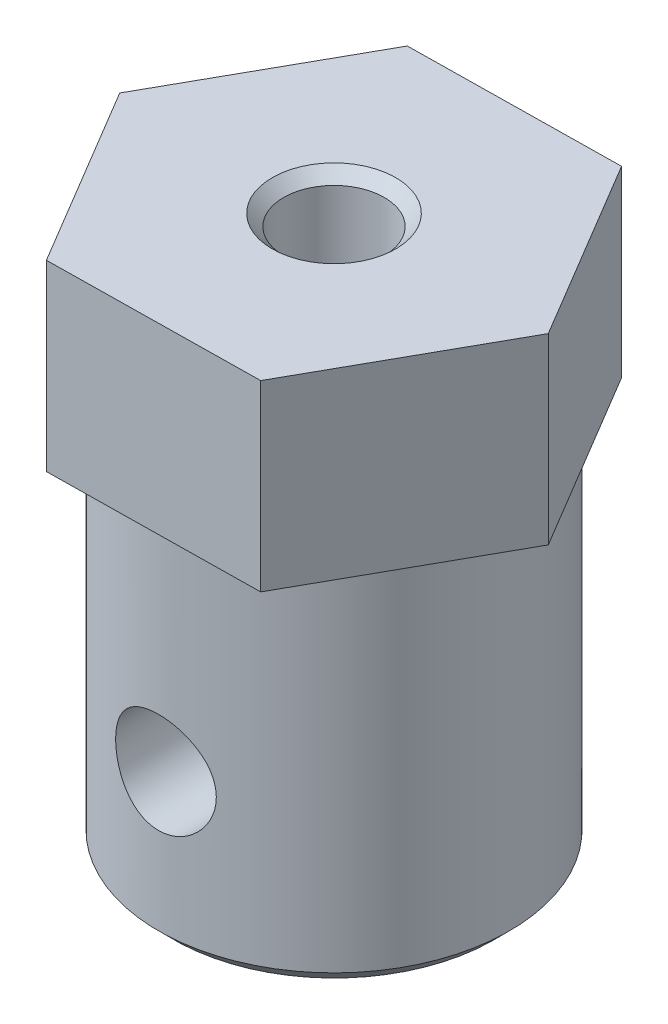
ISO-10303-21;
HEADER;
FILE_DESCRIPTION(('STEP AP214'),'2;1');
FILE_NAME('part.step','',(''),(''),'','','');
FILE_SCHEMA(('AUTOMOTIVE_DESIGN { 1 0 10303 214 1 1 1 1 }'));
ENDSEC;
DATA;
#1=APPLICATION_CONTEXT('core data for automotive mechanical design processes');
#2=APPLICATION_PROTOCOL_DEFINITION('international standard','automotive_design',2000,#1);
#3=PRODUCT_CONTEXT('',#1,'mechanical');
#4=PRODUCT('Part','Part','',(#3));
#5=PRODUCT_RELATED_PRODUCT_CATEGORY('part','',(#4));
#6=PRODUCT_DEFINITION_FORMATION('','',#4);
#7=PRODUCT_DEFINITION_CONTEXT('part definition',#1,'design');
#8=PRODUCT_DEFINITION('design','',#6,#7);
#9=PRODUCT_DEFINITION_SHAPE('','',#8);
#10=(LENGTH_UNIT() NAMED_UNIT(*) SI_UNIT(.MILLI.,.METRE.));
#11=(NAMED_UNIT(*) PLANE_ANGLE_UNIT() SI_UNIT($,.RADIAN.));
#12=(NAMED_UNIT(*) SI_UNIT($,.STERADIAN.) SOLID_ANGLE_UNIT());
#13=UNCERTAINTY_MEASURE_WITH_UNIT(LENGTH_MEASURE(1.E-05),#10,'distance_accuracy_value','');
#14=(GEOMETRIC_REPRESENTATION_CONTEXT(3) GLOBAL_UNCERTAINTY_ASSIGNED_CONTEXT((#13)) GLOBAL_UNIT_ASSIGNED_CONTEXT((#10,
#11,#12)) REPRESENTATION_CONTEXT('',''));
#15=CARTESIAN_POINT('',(0.,0.,0.));
#16=DIRECTION('',(0.,0.,1.));
#17=DIRECTION('',(1.,0.,0.));
#18=AXIS2_PLACEMENT_3D('',#15,#16,#17);
#19=CARTESIAN_POINT('',(0.,0.,0.));
#20=DIRECTION('',(0.,1.,0.));
#21=DIRECTION('',(0.,0.,1.));
#22=AXIS2_PLACEMENT_3D('',#19,#20,#21);
#23=PLANE('',#22);
#24=CARTESIAN_POINT('',(0.,0.,0.));
#25=DIRECTION('',(0.,1.,0.));
#26=DIRECTION('',(0.,0.,1.));
#27=AXIS2_PLACEMENT_3D('',#24,#25,#26);
#28=CIRCLE('',#27,1.65);
#29=CARTESIAN_POINT('',(0.,0.,1.65));
#30=VERTEX_POINT('',#29);
#31=EDGE_CURVE('E136',#30,#30,#28,.T.);
#32=ORIENTED_EDGE('',*,*,#31,.T.);
#33=EDGE_LOOP('',(#32));
#34=FACE_BOUND('',#33,.T.);
#35=CARTESIAN_POINT('',(0.,0.,0.));
#36=DIRECTION('',(0.,-1.,0.));
#37=DIRECTION('',(0.,0.,-1.));
#38=AXIS2_PLACEMENT_3D('',#35,#36,#37);
#39=CIRCLE('',#38,3.);
#40=CARTESIAN_POINT('',(0.,0.,-3.));
#41=VERTEX_POINT('',#40);
#42=EDGE_CURVE('E183',#41,#41,#39,.T.);
#43=ORIENTED_EDGE('',*,*,#42,.T.);
#44=EDGE_LOOP('',(#43));
#45=FACE_BOUND('',#44,.T.);
#46=ADVANCED_FACE('F45',(#34,#45),#23,.F.);
#47=CARTESIAN_POINT('',(3.37983823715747,6.,-6.04786685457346));
#48=DIRECTION('',(0.0139874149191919,0.,0.999902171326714));
#49=DIRECTION('',(0.999902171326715,0.,-0.0139874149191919));
#50=AXIS2_PLACEMENT_3D('',#47,#48,#49);
#51=PLANE('',#50);
#52=DIRECTION('',(-0.999902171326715,0.,0.0139874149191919));
#53=VECTOR('',#52,1.);
#54=CARTESIAN_POINT('',(3.37983823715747,0.,-6.04786685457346));
#55=LINE('',#54,#53);
#56=CARTESIAN_POINT('',(3.37983823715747,0.,-6.04786685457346));
#57=VERTEX_POINT('',#56);
#58=CARTESIAN_POINT('',(-3.54768721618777,0.,-5.95095920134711));
#59=VERTEX_POINT('',#58);
#60=EDGE_CURVE('E132',#57,#59,#55,.T.);
#61=ORIENTED_EDGE('',*,*,#60,.T.);
#62=DIRECTION('',(0.,-1.,0.));
#63=VECTOR('',#62,1.);
#64=CARTESIAN_POINT('',(-3.54768721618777,6.,-5.95095920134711));
#65=LINE('',#64,#63);
#66=CARTESIAN_POINT('',(-3.54768721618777,6.,-5.95095920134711));
#67=VERTEX_POINT('',#66);
#68=EDGE_CURVE('E150',#67,#59,#65,.T.);
#69=ORIENTED_EDGE('',*,*,#68,.F.);
#70=DIRECTION('',(-0.999902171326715,0.,0.0139874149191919));
#71=VECTOR('',#70,1.);
#72=CARTESIAN_POINT('',(3.37983823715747,6.,-6.04786685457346));
#73=LINE('',#72,#71);
#74=CARTESIAN_POINT('',(3.37983823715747,6.,-6.04786685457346));
#75=VERTEX_POINT('',#74);
#76=EDGE_CURVE('E143',#75,#67,#73,.T.);
#77=ORIENTED_EDGE('',*,*,#76,.F.);
#78=DIRECTION('',(0.,-1.,0.));
#79=VECTOR('',#78,1.);
#80=CARTESIAN_POINT('',(3.37983823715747,6.,-6.04786685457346));
#81=LINE('',#80,#79);
#82=EDGE_CURVE('E128',#75,#57,#81,.T.);
#83=ORIENTED_EDGE('',*,*,#82,.T.);
#84=EDGE_LOOP('',(#61,#69,#77,#83));
#85=FACE_BOUND('',#84,.T.);
#86=ADVANCED_FACE('F207',(#85),#51,.F.);
#87=CARTESIAN_POINT('',(-3.54768721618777,6.,-5.95095920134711));
#88=DIRECTION('',(0.872934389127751,0.,0.487837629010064));
#89=DIRECTION('',(0.487837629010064,0.,-0.872934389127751));
#90=AXIS2_PLACEMENT_3D('',#87,#88,#89);
#91=PLANE('',#90);
#92=DIRECTION('',(-0.487837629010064,0.,0.872934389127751));
#93=VECTOR('',#92,1.);
#94=CARTESIAN_POINT('',(-3.54768721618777,0.,-5.95095920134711));
#95=LINE('',#94,#93);
#96=CARTESIAN_POINT('',(-6.92752545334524,0.,0.0969076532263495));
#97=VERTEX_POINT('',#96);
#98=EDGE_CURVE('E135',#59,#97,#95,.T.);
#99=ORIENTED_EDGE('',*,*,#98,.T.);
#100=DIRECTION('',(0.,-1.,0.));
#101=VECTOR('',#100,1.);
#102=CARTESIAN_POINT('',(-6.92752545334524,6.,0.0969076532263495));
#103=LINE('',#102,#101);
#104=CARTESIAN_POINT('',(-6.92752545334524,6.,0.0969076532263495));
#105=VERTEX_POINT('',#104);
#106=EDGE_CURVE('E147',#105,#97,#103,.T.);
#107=ORIENTED_EDGE('',*,*,#106,.F.);
#108=DIRECTION('',(-0.487837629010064,0.,0.872934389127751));
#109=VECTOR('',#108,1.);
#110=CARTESIAN_POINT('',(-3.54768721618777,6.,-5.95095920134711));
#111=LINE('',#110,#109);
#112=EDGE_CURVE('E101',#67,#105,#111,.T.);
#113=ORIENTED_EDGE('',*,*,#112,.F.);
#114=ORIENTED_EDGE('',*,*,#68,.T.);
#115=EDGE_LOOP('',(#99,#107,#113,#114));
#116=FACE_BOUND('',#115,.T.);
#117=ADVANCED_FACE('F199',(#116),#91,.F.);
#118=CARTESIAN_POINT('',(-6.92752545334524,6.,0.0969076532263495));
#119=DIRECTION('',(0.858946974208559,0.,-0.512064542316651));
#120=DIRECTION('',(-0.512064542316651,0.,-0.858946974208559));
#121=AXIS2_PLACEMENT_3D('',#118,#119,#120);
#122=PLANE('',#121);
#123=DIRECTION('',(0.512064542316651,0.,0.858946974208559));
#124=VECTOR('',#123,1.);
#125=CARTESIAN_POINT('',(-6.92752545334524,0.,0.0969076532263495));
#126=LINE('',#125,#124);
#127=CARTESIAN_POINT('',(-3.37983823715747,0.,6.04786685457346));
#128=VERTEX_POINT('',#127);
#129=EDGE_CURVE('E138',#97,#128,#126,.T.);
#130=ORIENTED_EDGE('',*,*,#129,.T.);
#131=DIRECTION('',(0.,-1.,0.));
#132=VECTOR('',#131,1.);
#133=CARTESIAN_POINT('',(-3.37983823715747,6.,6.04786685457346));
#134=LINE('',#133,#132);
#135=CARTESIAN_POINT('',(-3.37983823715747,6.,6.04786685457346));
#136=VERTEX_POINT('',#135);
#137=EDGE_CURVE('E123',#136,#128,#134,.T.);
#138=ORIENTED_EDGE('',*,*,#137,.F.);
#139=DIRECTION('',(0.512064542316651,0.,0.858946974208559));
#140=VECTOR('',#139,1.);
#141=CARTESIAN_POINT('',(-6.92752545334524,6.,0.0969076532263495));
#142=LINE('',#141,#140);
#143=EDGE_CURVE('E114',#105,#136,#142,.T.);
#144=ORIENTED_EDGE('',*,*,#143,.F.);
#145=ORIENTED_EDGE('',*,*,#106,.T.);
#146=EDGE_LOOP('',(#130,#138,#144,#145));
#147=FACE_BOUND('',#146,.T.);
#148=ADVANCED_FACE('F202',(#147),#122,.F.);
#149=CARTESIAN_POINT('',(-3.37983823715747,6.,6.04786685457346));
#150=DIRECTION('',(-0.0139874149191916,0.,-0.999902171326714));
#151=DIRECTION('',(-0.999902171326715,0.,0.0139874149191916));
#152=AXIS2_PLACEMENT_3D('',#149,#150,#151);
#153=PLANE('',#152);
#154=DIRECTION('',(0.999902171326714,0.,-0.0139874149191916));
#155=VECTOR('',#154,1.);
#156=CARTESIAN_POINT('',(-3.37983823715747,0.,6.04786685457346));
#157=LINE('',#156,#155);
#158=CARTESIAN_POINT('',(3.54768721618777,0.,5.95095920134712));
#159=VERTEX_POINT('',#158);
#160=EDGE_CURVE('E122',#128,#159,#157,.T.);
#161=ORIENTED_EDGE('',*,*,#160,.T.);
#162=DIRECTION('',(0.,-1.,0.));
#163=VECTOR('',#162,1.);
#164=CARTESIAN_POINT('',(3.54768721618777,6.,5.95095920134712));
#165=LINE('',#164,#163);
#166=CARTESIAN_POINT('',(3.54768721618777,6.,5.95095920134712));
#167=VERTEX_POINT('',#166);
#168=EDGE_CURVE('E119',#167,#159,#165,.T.);
#169=ORIENTED_EDGE('',*,*,#168,.F.);
#170=DIRECTION('',(0.999902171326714,0.,-0.0139874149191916));
#171=VECTOR('',#170,1.);
#172=CARTESIAN_POINT('',(-3.37983823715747,6.,6.04786685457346));
#173=LINE('',#172,#171);
#174=EDGE_CURVE('E108',#136,#167,#173,.T.);
#175=ORIENTED_EDGE('',*,*,#174,.F.);
#176=ORIENTED_EDGE('',*,*,#137,.T.);
#177=EDGE_LOOP('',(#161,#169,#175,#176));
#178=FACE_BOUND('',#177,.T.);
#179=ADVANCED_FACE('F120',(#178),#153,.F.);
#180=CARTESIAN_POINT('',(3.54768721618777,6.,5.95095920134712));
#181=DIRECTION('',(-0.872934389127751,0.,-0.487837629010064));
#182=DIRECTION('',(-0.487837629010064,0.,0.872934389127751));
#183=AXIS2_PLACEMENT_3D('',#180,#181,#182);
#184=PLANE('',#183);
#185=DIRECTION('',(0.487837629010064,0.,-0.872934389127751));
#186=VECTOR('',#185,1.);
#187=CARTESIAN_POINT('',(3.54768721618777,0.,5.95095920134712));
#188=LINE('',#187,#186);
#189=CARTESIAN_POINT('',(6.92752545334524,0.,-0.0969076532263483));
#190=VERTEX_POINT('',#189);
#191=EDGE_CURVE('E86',#159,#190,#188,.T.);
#192=ORIENTED_EDGE('',*,*,#191,.T.);
#193=DIRECTION('',(0.,-1.,0.));
#194=VECTOR('',#193,1.);
#195=CARTESIAN_POINT('',(6.92752545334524,6.,-0.0969076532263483));
#196=LINE('',#195,#194);
#197=CARTESIAN_POINT('',(6.92752545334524,6.,-0.0969076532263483));
#198=VERTEX_POINT('',#197);
#199=EDGE_CURVE('E124',#198,#190,#196,.T.);
#200=ORIENTED_EDGE('',*,*,#199,.F.);
#201=DIRECTION('',(0.487837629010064,0.,-0.872934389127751));
#202=VECTOR('',#201,1.);
#203=CARTESIAN_POINT('',(3.54768721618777,6.,5.95095920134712));
#204=LINE('',#203,#202);
#205=EDGE_CURVE('E112',#167,#198,#204,.T.);
#206=ORIENTED_EDGE('',*,*,#205,.F.);
#207=ORIENTED_EDGE('',*,*,#168,.T.);
#208=EDGE_LOOP('',(#192,#200,#206,#207));
#209=FACE_BOUND('',#208,.T.);
#210=ADVANCED_FACE('F126',(#209),#184,.F.);
#211=CARTESIAN_POINT('',(6.92752545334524,6.,-0.0969076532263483));
#212=DIRECTION('',(-0.858946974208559,0.,0.512064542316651));
#213=DIRECTION('',(0.512064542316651,0.,0.858946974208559));
#214=AXIS2_PLACEMENT_3D('',#211,#212,#213);
#215=PLANE('',#214);
#216=DIRECTION('',(-0.512064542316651,0.,-0.858946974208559));
#217=VECTOR('',#216,1.);
#218=CARTESIAN_POINT('',(6.92752545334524,0.,-0.0969076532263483));
#219=LINE('',#218,#217);
#220=EDGE_CURVE('E92',#190,#57,#219,.T.);
#221=ORIENTED_EDGE('',*,*,#220,.T.);
#222=ORIENTED_EDGE('',*,*,#82,.F.);
#223=DIRECTION('',(-0.512064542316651,0.,-0.858946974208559));
#224=VECTOR('',#223,1.);
#225=CARTESIAN_POINT('',(6.92752545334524,6.,-0.0969076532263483));
#226=LINE('',#225,#224);
#227=EDGE_CURVE('E63',#198,#75,#226,.T.);
#228=ORIENTED_EDGE('',*,*,#227,.F.);
#229=ORIENTED_EDGE('',*,*,#199,.T.);
#230=EDGE_LOOP('',(#221,#222,#228,#229));
#231=FACE_BOUND('',#230,.T.);
#232=ADVANCED_FACE('F208',(#231),#215,.F.);
#233=CARTESIAN_POINT('',(0.,6.,0.));
#234=DIRECTION('',(0.,1.,0.));
#235=DIRECTION('',(0.,0.,1.));
#236=AXIS2_PLACEMENT_3D('',#233,#234,#235);
#237=PLANE('',#236);
#238=CARTESIAN_POINT('',(0.,6.,0.));
#239=DIRECTION('',(0.,1.,0.));
#240=DIRECTION('',(0.,0.,1.));
#241=AXIS2_PLACEMENT_3D('',#238,#239,#240);
#242=CIRCLE('',#241,2.025);
#243=CARTESIAN_POINT('',(0.,6.,2.025));
#244=VERTEX_POINT('',#243);
#245=EDGE_CURVE('E186',#244,#244,#242,.T.);
#246=ORIENTED_EDGE('',*,*,#245,.F.);
#247=EDGE_LOOP('',(#246));
#248=FACE_BOUND('',#247,.T.);
#249=ORIENTED_EDGE('',*,*,#76,.T.);
#250=ORIENTED_EDGE('',*,*,#112,.T.);
#251=ORIENTED_EDGE('',*,*,#143,.T.);
#252=ORIENTED_EDGE('',*,*,#174,.T.);
#253=ORIENTED_EDGE('',*,*,#205,.T.);
#254=ORIENTED_EDGE('',*,*,#227,.T.);
#255=EDGE_LOOP('',(#249,#250,#251,#252,#253,#254));
#256=FACE_BOUND('',#255,.T.);
#257=ADVANCED_FACE('F110',(#248,#256),#237,.T.);
#258=CARTESIAN_POINT('',(0.,0.,0.));
#259=DIRECTION('',(0.,-1.,0.));
#260=DIRECTION('',(0.,0.,-1.));
#261=AXIS2_PLACEMENT_3D('',#258,#259,#260);
#262=CIRCLE('',#261,5.75);
#263=CARTESIAN_POINT('',(0.,0.,-5.75));
#264=VERTEX_POINT('',#263);
#265=EDGE_CURVE('E152',#264,#264,#262,.T.);
#266=ORIENTED_EDGE('',*,*,#265,.F.);
#267=EDGE_LOOP('',(#266));
#268=FACE_BOUND('',#267,.T.);
#269=ORIENTED_EDGE('',*,*,#60,.F.);
#270=ORIENTED_EDGE('',*,*,#220,.F.);
#271=ORIENTED_EDGE('',*,*,#191,.F.);
#272=ORIENTED_EDGE('',*,*,#160,.F.);
#273=ORIENTED_EDGE('',*,*,#129,.F.);
#274=ORIENTED_EDGE('',*,*,#98,.F.);
#275=EDGE_LOOP('',(#269,#270,#271,#272,#273,#274));
#276=FACE_BOUND('',#275,.T.);
#277=ADVANCED_FACE('F205',(#268,#276),#23,.F.);
#278=CARTESIAN_POINT('',(0.,6.,0.));
#279=DIRECTION('',(0.,1.,0.));
#280=DIRECTION('',(0.,0.,1.));
#281=AXIS2_PLACEMENT_3D('',#278,#279,#280);
#282=CYLINDRICAL_SURFACE('',#281,1.65);
#283=ORIENTED_EDGE('',*,*,#31,.F.);
#284=EDGE_LOOP('',(#283));
#285=FACE_BOUND('',#284,.T.);
#286=CARTESIAN_POINT('',(0.,5.625,0.));
#287=DIRECTION('',(0.,1.,0.));
#288=DIRECTION('',(0.,0.,1.));
#289=AXIS2_PLACEMENT_3D('',#286,#287,#288);
#290=CIRCLE('',#289,1.65);
#291=CARTESIAN_POINT('',(0.,5.625,1.65));
#292=VERTEX_POINT('',#291);
#293=EDGE_CURVE('E191',#292,#292,#290,.T.);
#294=ORIENTED_EDGE('',*,*,#293,.T.);
#295=EDGE_LOOP('',(#294));
#296=FACE_BOUND('',#295,.T.);
#297=ADVANCED_FACE('F227',(#285,#296),#282,.F.);
#298=CARTESIAN_POINT('',(0.,6.,0.));
#299=DIRECTION('',(0.,1.,0.));
#300=DIRECTION('',(0.,0.,1.));
#301=AXIS2_PLACEMENT_3D('',#298,#299,#300);
#302=CONICAL_SURFACE('',#301,2.025,0.785398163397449);
#303=ORIENTED_EDGE('',*,*,#293,.F.);
#304=EDGE_LOOP('',(#303));
#305=FACE_BOUND('',#304,.T.);
#306=ORIENTED_EDGE('',*,*,#245,.T.);
#307=EDGE_LOOP('',(#306));
#308=FACE_BOUND('',#307,.T.);
#309=ADVANCED_FACE('F232',(#305,#308),#302,.F.);
#310=CARTESIAN_POINT('',(0.,-12.,0.));
#311=DIRECTION('',(0.,-1.,0.));
#312=DIRECTION('',(0.,0.,-1.));
#313=AXIS2_PLACEMENT_3D('',#310,#311,#312);
#314=PLANE('',#313);
#315=CARTESIAN_POINT('',(0.,-12.,0.));
#316=DIRECTION('',(0.,-1.,0.));
#317=DIRECTION('',(0.,0.,-1.));
#318=AXIS2_PLACEMENT_3D('',#315,#316,#317);
#319=CIRCLE('',#318,5.25);
#320=CARTESIAN_POINT('',(0.,-12.,-5.25));
#321=VERTEX_POINT('',#320);
#322=EDGE_CURVE('E252',#321,#321,#319,.T.);
#323=ORIENTED_EDGE('',*,*,#322,.T.);
#324=EDGE_LOOP('',(#323));
#325=FACE_BOUND('',#324,.T.);
#326=CARTESIAN_POINT('',(0.,-12.,0.));
#327=DIRECTION('',(0.,-1.,0.));
#328=DIRECTION('',(0.,0.,-1.));
#329=AXIS2_PLACEMENT_3D('',#326,#327,#328);
#330=CIRCLE('',#329,3.5);
#331=CARTESIAN_POINT('',(0.,-12.,-3.5));
#332=VERTEX_POINT('',#331);
#333=EDGE_CURVE('E162',#332,#332,#330,.F.);
#334=ORIENTED_EDGE('',*,*,#333,.T.);
#335=EDGE_LOOP('',(#334));
#336=FACE_BOUND('',#335,.T.);
#337=ADVANCED_FACE('F238',(#325,#336),#314,.T.);
#338=CARTESIAN_POINT('',(0.,-12.,0.));
#339=DIRECTION('',(0.,1.,0.));
#340=DIRECTION('',(0.,0.,1.));
#341=AXIS2_PLACEMENT_3D('',#338,#339,#340);
#342=CYLINDRICAL_SURFACE('',#341,5.75);
#343=CARTESIAN_POINT('',(0.,-11.5,0.));
#344=DIRECTION('',(0.,-1.,0.));
#345=DIRECTION('',(0.,0.,-1.));
#346=AXIS2_PLACEMENT_3D('',#343,#344,#345);
#347=CIRCLE('',#346,5.75);
#348=CARTESIAN_POINT('',(0.,-11.5,-5.75));
#349=VERTEX_POINT('',#348);
#350=EDGE_CURVE('E55',#349,#349,#347,.F.);
#351=ORIENTED_EDGE('',*,*,#350,.T.);
#352=EDGE_LOOP('',(#351));
#353=FACE_BOUND('',#352,.T.);
#354=CARTESIAN_POINT('',(0.,-8.65,5.75));
#355=CARTESIAN_POINT('',(-0.0906961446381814,-8.64999844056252,5.74999894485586));
#356=CARTESIAN_POINT('',(-0.181408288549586,-8.6424970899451,5.7478333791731));
#357=CARTESIAN_POINT('',(-0.360202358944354,-8.61275373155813,5.73940553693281));
#358=CARTESIAN_POINT('',(-0.448283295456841,-8.5905062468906,5.73314173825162));
#359=CARTESIAN_POINT('',(-0.619209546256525,-8.53206625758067,5.71720581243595));
#360=CARTESIAN_POINT('',(-0.702062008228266,-8.49589329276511,5.70753846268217));
#361=CARTESIAN_POINT('',(-0.860525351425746,-8.41070622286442,5.68580699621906));
#362=CARTESIAN_POINT('',(-0.936135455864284,-8.36169074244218,5.67374262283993));
#363=CARTESIAN_POINT('',(-1.07997125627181,-8.25084027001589,5.64815284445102));
#364=CARTESIAN_POINT('',(-1.14797782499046,-8.18872741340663,5.63459945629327));
#365=CARTESIAN_POINT('',(-1.27276632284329,-8.05403823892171,5.6077311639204));
#366=CARTESIAN_POINT('',(-1.3295465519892,-7.98146033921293,5.59441629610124));
#367=CARTESIAN_POINT('',(-1.4313891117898,-7.8260898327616,5.56924061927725));
#368=CARTESIAN_POINT('',(-1.47619022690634,-7.74311980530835,5.55741480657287));
#369=CARTESIAN_POINT('',(-1.55111673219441,-7.57042980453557,5.53697172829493));
#370=CARTESIAN_POINT('',(-1.58124531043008,-7.48071130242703,5.5283537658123));
#371=CARTESIAN_POINT('',(-1.6251930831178,-7.29951867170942,5.51559267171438));
#372=CARTESIAN_POINT('',(-1.63941362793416,-7.20814982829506,5.51133965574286));
#373=CARTESIAN_POINT('',(-1.65239419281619,-7.02423191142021,5.50746251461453));
#374=CARTESIAN_POINT('',(-1.65115760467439,-6.93168310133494,5.50783737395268));
#375=CARTESIAN_POINT('',(-1.63357560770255,-6.75124190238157,5.51307584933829));
#376=CARTESIAN_POINT('',(-1.61772590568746,-6.66329624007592,5.51779218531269));
#377=CARTESIAN_POINT('',(-1.57216567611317,-6.49136850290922,5.53094492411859));
#378=CARTESIAN_POINT('',(-1.54245388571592,-6.40738678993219,5.53938166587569));
#379=CARTESIAN_POINT('',(-1.46963231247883,-6.2445263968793,5.55914691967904));
#380=CARTESIAN_POINT('',(-1.42635655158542,-6.16572642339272,5.57051092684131));
#381=CARTESIAN_POINT('',(-1.32775098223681,-6.01633746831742,5.59483240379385));
#382=CARTESIAN_POINT('',(-1.27241846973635,-5.94575033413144,5.60779023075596));
#383=CARTESIAN_POINT('',(-1.14877872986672,-5.81197057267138,5.63444304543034));
#384=CARTESIAN_POINT('',(-1.08005808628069,-5.74916126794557,5.64814732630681));
#385=CARTESIAN_POINT('',(-0.932889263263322,-5.63587353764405,5.67431013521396));
#386=CARTESIAN_POINT('',(-0.854440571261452,-5.58539576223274,5.68676859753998));
#387=CARTESIAN_POINT('',(-0.689387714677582,-5.49799756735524,5.70913392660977));
#388=CARTESIAN_POINT('',(-0.602739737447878,-5.46115582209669,5.71902589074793));
#389=CARTESIAN_POINT('',(-0.424129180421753,-5.40267769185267,5.73503628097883));
#390=CARTESIAN_POINT('',(-0.332167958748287,-5.38103743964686,5.74115566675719));
#391=CARTESIAN_POINT('',(-0.148805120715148,-5.3542000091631,5.74878229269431));
#392=CARTESIAN_POINT('',(-0.0574855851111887,-5.34848268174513,5.75043537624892));
#393=CARTESIAN_POINT('',(0.124810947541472,-5.35220416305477,5.74936754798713));
#394=CARTESIAN_POINT('',(0.215787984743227,-5.36164113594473,5.7466471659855));
#395=CARTESIAN_POINT('',(0.392896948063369,-5.39498007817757,5.7372330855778));
#396=CARTESIAN_POINT('',(0.479089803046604,-5.41858369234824,5.73062139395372));
#397=CARTESIAN_POINT('',(0.646277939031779,-5.47923200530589,5.71418299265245));
#398=CARTESIAN_POINT('',(0.727272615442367,-5.51627826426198,5.70435590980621));
#399=CARTESIAN_POINT('',(0.883722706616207,-5.60367002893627,5.68224574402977));
#400=CARTESIAN_POINT('',(0.959019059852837,-5.65428761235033,5.66991383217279));
#401=CARTESIAN_POINT('',(1.10022857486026,-5.76705010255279,5.6442144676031));
#402=CARTESIAN_POINT('',(1.16613957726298,-5.82919765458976,5.63084677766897));
#403=CARTESIAN_POINT('',(1.28895901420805,-5.96569471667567,5.60403174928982));
#404=CARTESIAN_POINT('',(1.34549838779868,-6.04037933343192,5.59059635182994));
#405=CARTESIAN_POINT('',(1.44526055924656,-6.19846635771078,5.56564246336));
#406=CARTESIAN_POINT('',(1.48848381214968,-6.28186846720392,5.55412390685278));
#407=CARTESIAN_POINT('',(1.56007293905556,-6.45468307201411,5.53444235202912));
#408=CARTESIAN_POINT('',(1.5885168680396,-6.54406111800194,5.52626177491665));
#409=CARTESIAN_POINT('',(1.62988071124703,-6.72661246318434,5.51420547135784));
#410=CARTESIAN_POINT('',(1.64280538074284,-6.81978459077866,5.51032842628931));
#411=CARTESIAN_POINT('',(1.65245987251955,-7.00346854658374,5.5074402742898));
#412=CARTESIAN_POINT('',(1.64978772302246,-7.09394655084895,5.50824947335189));
#413=CARTESIAN_POINT('',(1.62973566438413,-7.27310433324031,5.51421515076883));
#414=CARTESIAN_POINT('',(1.61235625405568,-7.36178417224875,5.51937148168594));
#415=CARTESIAN_POINT('',(1.56375384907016,-7.53394202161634,5.53333519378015));
#416=CARTESIAN_POINT('',(1.53267641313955,-7.61746446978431,5.54210412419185));
#417=CARTESIAN_POINT('',(1.45767276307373,-7.77817581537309,5.56230093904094));
#418=CARTESIAN_POINT('',(1.41374425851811,-7.85536358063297,5.57372929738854));
#419=CARTESIAN_POINT('',(1.31255246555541,-8.00402207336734,5.59843739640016));
#420=CARTESIAN_POINT('',(1.25489022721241,-8.07521304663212,5.61176649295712));
#421=CARTESIAN_POINT('',(1.12860221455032,-8.20710239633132,5.63852078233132));
#422=CARTESIAN_POINT('',(1.05997367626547,-8.26779811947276,5.65194599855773));
#423=CARTESIAN_POINT('',(0.911554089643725,-8.37853591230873,5.67779722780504));
#424=CARTESIAN_POINT('',(0.83151957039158,-8.42826061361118,5.69018826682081));
#425=CARTESIAN_POINT('',(0.663871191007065,-8.5134746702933,5.71217142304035));
#426=CARTESIAN_POINT('',(0.576261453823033,-8.54897171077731,5.72176505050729));
#427=CARTESIAN_POINT('',(0.407690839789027,-8.60094673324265,5.73606952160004));
#428=CARTESIAN_POINT('',(0.327342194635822,-8.61929484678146,5.74125239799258));
#429=CARTESIAN_POINT('',(0.16466658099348,-8.64382135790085,5.7482178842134));
#430=CARTESIAN_POINT('',(0.0823398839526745,-8.65000141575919,5.75000095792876));
#431=CARTESIAN_POINT('',(0.,-8.65,5.75));
#432=B_SPLINE_CURVE_WITH_KNOTS('',3,(#354,#355,#356,#357,#358,#359,#360,#361,#362,#363,#364,
#365,#366,#367,#368,#369,#370,#371,#372,#373,#374,#375,#376,#377,#378,#379,#380,#381,#382,#383,
#384,#385,#386,#387,#388,#389,#390,#391,#392,#393,#394,#395,#396,#397,#398,#399,#400,#401,#402,
#403,#404,#405,#406,#407,#408,#409,#410,#411,#412,#413,#414,#415,#416,#417,#418,#419,#420,#421,
#422,#423,#424,#425,#426,#427,#428,#429,#430,#431),.UNSPECIFIED.,.T.,.F.,(4,2,2,2,2,2,2,2,2,2,2,
2,2,2,2,2,2,2,2,2,2,2,2,2,2,2,2,2,2,2,2,2,2,2,2,2,2,2,4),(0.,0.271786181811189,
0.543673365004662,0.81518042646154,1.08671657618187,1.36472887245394,1.64278323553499,
1.92648098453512,2.21011706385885,2.48642335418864,2.76266901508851,3.02987551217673,
3.29710635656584,3.56774404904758,3.83844250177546,4.1194360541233,4.40044441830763,
4.68304970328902,4.96558306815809,5.23877224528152,5.51192832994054,5.7795241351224,
6.047151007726,6.32060664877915,6.5941251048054,6.87667374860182,7.15921273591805,
7.44024396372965,7.72118905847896,7.99143446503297,8.26167070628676,8.52910208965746,
8.79658116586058,9.07306028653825,9.34960920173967,9.63333523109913,9.91690779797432,
10.1636867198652,10.4104319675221),.UNSPECIFIED.);
#433=CARTESIAN_POINT('',(0.,-8.65,5.75));
#434=VERTEX_POINT('',#433);
#435=EDGE_CURVE('E153',#434,#434,#432,.T.);
#436=ORIENTED_EDGE('',*,*,#435,.T.);
#437=EDGE_LOOP('',(#436));
#438=FACE_BOUND('',#437,.T.);
#439=ORIENTED_EDGE('',*,*,#265,.T.);
#440=EDGE_LOOP('',(#439));
#441=FACE_BOUND('',#440,.T.);
#442=ADVANCED_FACE('F164',(#353,#438,#441),#342,.T.);
#443=CARTESIAN_POINT('',(0.,-12.,0.));
#444=DIRECTION('',(0.,1.,0.));
#445=DIRECTION('',(0.,0.,1.));
#446=AXIS2_PLACEMENT_3D('',#443,#444,#445);
#447=CYLINDRICAL_SURFACE('',#446,3.);
#448=CARTESIAN_POINT('',(0.,-11.5,0.));
#449=DIRECTION('',(0.,-1.,0.));
#450=DIRECTION('',(0.,0.,-1.));
#451=AXIS2_PLACEMENT_3D('',#448,#449,#450);
#452=CIRCLE('',#451,3.);
#453=CARTESIAN_POINT('',(0.,-11.5,-3.));
#454=VERTEX_POINT('',#453);
#455=EDGE_CURVE('E11',#454,#454,#452,.T.);
#456=ORIENTED_EDGE('',*,*,#455,.T.);
#457=EDGE_LOOP('',(#456));
#458=FACE_BOUND('',#457,.T.);
#459=CARTESIAN_POINT('',(0.,-8.65,3.));
#460=CARTESIAN_POINT('',(-0.0856699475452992,-8.64999461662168,2.99999513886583));
#461=CARTESIAN_POINT('',(-0.171409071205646,-8.64328935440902,2.99629302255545));
#462=CARTESIAN_POINT('',(-0.340286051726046,-8.61679778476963,2.9818478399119));
#463=CARTESIAN_POINT('',(-0.423420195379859,-8.59699362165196,2.97109516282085));
#464=CARTESIAN_POINT('',(-0.584401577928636,-8.54534553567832,2.9436571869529));
#465=CARTESIAN_POINT('',(-0.662269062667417,-8.51355122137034,2.9269963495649));
#466=CARTESIAN_POINT('',(-0.811408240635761,-8.43912133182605,2.8892116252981));
#467=CARTESIAN_POINT('',(-0.882679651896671,-8.39648529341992,2.86808754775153));
#468=CARTESIAN_POINT('',(-1.02211619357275,-8.29828466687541,2.82153252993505));
#469=CARTESIAN_POINT('',(-1.0897303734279,-8.24203247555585,2.79590528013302));
#470=CARTESIAN_POINT('',(-1.21508634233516,-8.11970839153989,2.74375354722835));
#471=CARTESIAN_POINT('',(-1.27281890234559,-8.05362742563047,2.71722825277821));
#472=CARTESIAN_POINT('',(-1.38251917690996,-7.90577401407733,2.66321895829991));
#473=CARTESIAN_POINT('',(-1.43335857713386,-7.82309703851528,2.635897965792));
#474=CARTESIAN_POINT('',(-1.52021547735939,-7.64877263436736,2.58678336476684));
#475=CARTESIAN_POINT('',(-1.5562446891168,-7.55713236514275,2.56498539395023));
#476=CARTESIAN_POINT('',(-1.60989890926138,-7.3732305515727,2.53163475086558));
#477=CARTESIAN_POINT('',(-1.62854263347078,-7.28137384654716,2.51952192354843));
#478=CARTESIAN_POINT('',(-1.64991120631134,-7.09511055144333,2.5055890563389));
#479=CARTESIAN_POINT('',(-1.65265887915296,-7.00070781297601,2.50375425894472));
#480=CARTESIAN_POINT('',(-1.64290000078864,-6.82757164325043,2.51015646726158));
#481=CARTESIAN_POINT('',(-1.63265157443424,-6.74864024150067,2.51690299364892));
#482=CARTESIAN_POINT('',(-1.60118639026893,-6.59387058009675,2.53703527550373));
#483=CARTESIAN_POINT('',(-1.57996463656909,-6.5180337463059,2.55042405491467));
#484=CARTESIAN_POINT('',(-1.52687641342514,-6.3695176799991,2.58256130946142));
#485=CARTESIAN_POINT('',(-1.49479033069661,-6.2969417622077,2.60141910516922));
#486=CARTESIAN_POINT('',(-1.42107429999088,-6.15782897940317,2.64240902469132));
#487=CARTESIAN_POINT('',(-1.3794402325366,-6.09129473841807,2.66454256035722));
#488=CARTESIAN_POINT('',(-1.28018349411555,-5.95510521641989,2.71379040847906));
#489=CARTESIAN_POINT('',(-1.22107458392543,-5.88661394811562,2.74113957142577));
#490=CARTESIAN_POINT('',(-1.09224532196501,-5.75997341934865,2.79497377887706));
#491=CARTESIAN_POINT('',(-1.02251777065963,-5.70183123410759,2.82145822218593));
#492=CARTESIAN_POINT('',(-0.868605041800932,-5.59378517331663,2.87272134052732));
#493=CARTESIAN_POINT('',(-0.783763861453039,-5.54469535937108,2.89726648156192));
#494=CARTESIAN_POINT('',(-0.605352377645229,-5.46191924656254,2.93971528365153));
#495=CARTESIAN_POINT('',(-0.511790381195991,-5.42821846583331,2.95762518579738));
#496=CARTESIAN_POINT('',(-0.327907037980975,-5.38038778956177,2.98333345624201));
#497=CARTESIAN_POINT('',(-0.238095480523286,-5.36472744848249,2.99191822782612));
#498=CARTESIAN_POINT('',(-0.0567325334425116,-5.34846917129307,3.00083376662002));
#499=CARTESIAN_POINT('',(0.034817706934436,-5.34786161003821,3.00116980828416));
#500=CARTESIAN_POINT('',(0.207487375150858,-5.36103451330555,2.99394177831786));
#501=CARTESIAN_POINT('',(0.28875177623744,-5.3734146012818,2.98714659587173));
#502=CARTESIAN_POINT('',(0.447838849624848,-5.40984259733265,2.96746793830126));
#503=CARTESIAN_POINT('',(0.525661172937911,-5.43389168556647,2.95458384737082));
#504=CARTESIAN_POINT('',(0.677753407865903,-5.49335761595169,2.92349378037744));
#505=CARTESIAN_POINT('',(0.751904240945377,-5.52901769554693,2.90517475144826));
#506=CARTESIAN_POINT('',(0.893363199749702,-5.61037134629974,2.86484215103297));
#507=CARTESIAN_POINT('',(0.960668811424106,-5.65606858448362,2.8428272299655));
#508=CARTESIAN_POINT('',(1.09455456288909,-5.76204471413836,2.79420331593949));
#509=CARTESIAN_POINT('',(1.16021004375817,-5.823383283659,2.76735592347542));
#510=CARTESIAN_POINT('',(1.28079913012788,-5.9559244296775,2.71365440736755));
#511=CARTESIAN_POINT('',(1.33572155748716,-6.02713715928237,2.6868003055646));
#512=CARTESIAN_POINT('',(1.43747254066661,-6.18416419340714,2.63385875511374));
#513=CARTESIAN_POINT('',(1.48334076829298,-6.27068307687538,2.60799295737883));
#514=CARTESIAN_POINT('',(1.55942876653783,-6.45199407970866,2.56323063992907));
#515=CARTESIAN_POINT('',(1.58967133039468,-6.54677391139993,2.54432398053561));
#516=CARTESIAN_POINT('',(1.6306246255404,-6.73226237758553,2.51825420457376));
#517=CARTESIAN_POINT('',(1.64294477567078,-6.8224747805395,2.51013022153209));
#518=CARTESIAN_POINT('',(1.65249034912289,-7.00401046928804,2.50386093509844));
#519=CARTESIAN_POINT('',(1.64972872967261,-7.09533273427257,2.50570706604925));
#520=CARTESIAN_POINT('',(1.63075691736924,-7.26321952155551,2.51807870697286));
#521=CARTESIAN_POINT('',(1.61642825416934,-7.34010097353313,2.52738874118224));
#522=CARTESIAN_POINT('',(1.57741079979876,-7.49019541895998,2.55192145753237));
#523=CARTESIAN_POINT('',(1.55271775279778,-7.56340689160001,2.56714656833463));
#524=CARTESIAN_POINT('',(1.492056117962,-7.70913964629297,2.60289749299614));
#525=CARTESIAN_POINT('',(1.45548954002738,-7.7813439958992,2.62369085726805));
#526=CARTESIAN_POINT('',(1.37268509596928,-7.91907602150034,2.66794671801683));
#527=CARTESIAN_POINT('',(1.32644209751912,-7.98460012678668,2.69141062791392));
#528=CARTESIAN_POINT('',(1.21715006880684,-8.11784973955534,2.74276036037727));
#529=CARTESIAN_POINT('',(1.15260264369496,-8.18430823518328,2.77076245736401));
#530=CARTESIAN_POINT('',(1.01279351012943,-8.30588442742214,2.82486614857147));
#531=CARTESIAN_POINT('',(0.937524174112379,-8.360993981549,2.85096636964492));
#532=CARTESIAN_POINT('',(0.77488726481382,-8.45993803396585,2.89948189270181));
#533=CARTESIAN_POINT('',(0.687189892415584,-8.50331356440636,2.92173740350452));
#534=CARTESIAN_POINT('',(0.504223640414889,-8.57410971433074,2.95878417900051));
#535=CARTESIAN_POINT('',(0.408974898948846,-8.60157124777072,2.97359457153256));
#536=CARTESIAN_POINT('',(0.260510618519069,-8.63014205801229,2.98911434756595));
#537=CARTESIAN_POINT('',(0.208783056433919,-8.63757243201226,2.99318008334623));
#538=CARTESIAN_POINT('',(0.104712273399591,-8.64750301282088,2.99862437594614));
#539=CARTESIAN_POINT('',(0.0523690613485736,-8.65000329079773,3.00000297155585));
#540=CARTESIAN_POINT('',(0.,-8.65,3.));
#541=B_SPLINE_CURVE_WITH_KNOTS('',3,(#459,#460,#461,#462,#463,#464,#465,#466,#467,#468,#469,
#470,#471,#472,#473,#474,#475,#476,#477,#478,#479,#480,#481,#482,#483,#484,#485,#486,#487,#488,
#489,#490,#491,#492,#493,#494,#495,#496,#497,#498,#499,#500,#501,#502,#503,#504,#505,#506,#507,
#508,#509,#510,#511,#512,#513,#514,#515,#516,#517,#518,#519,#520,#521,#522,#523,#524,#525,#526,
#527,#528,#529,#530,#531,#532,#533,#534,#535,#536,#537,#538,#539,#540),.UNSPECIFIED.,.T.,.F.,(4,
2,2,2,2,2,2,2,2,2,2,2,2,2,2,2,2,2,2,2,2,2,2,2,2,2,2,2,2,2,2,2,2,2,2,2,2,2,2,2,4),(0.,
0.256799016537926,0.513948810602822,0.770046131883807,1.02615439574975,1.29988051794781,
1.57386091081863,1.87483382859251,2.17556827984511,2.45730761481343,2.73864231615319,
2.97715628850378,3.21577894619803,3.4595457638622,3.70341795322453,3.9857698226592,
4.26831398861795,4.56980790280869,4.87101750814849,5.14417314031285,5.41715410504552,
5.66345591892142,5.90978264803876,6.16164305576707,6.41359563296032,6.6937529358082,
6.97420047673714,7.27643629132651,7.57822997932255,7.85076329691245,8.1230625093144,
8.35830132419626,8.59363682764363,8.84338665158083,9.09326927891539,9.38234984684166,
9.67163710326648,9.97098879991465,10.2695674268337,10.4265480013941,10.5835263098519),.UNSPECIFIED.);
#542=CARTESIAN_POINT('',(0.,-8.65,3.));
#543=VERTEX_POINT('',#542);
#544=EDGE_CURVE('E161',#543,#543,#541,.T.);
#545=ORIENTED_EDGE('',*,*,#544,.F.);
#546=EDGE_LOOP('',(#545));
#547=FACE_BOUND('',#546,.T.);
#548=ORIENTED_EDGE('',*,*,#42,.F.);
#549=EDGE_LOOP('',(#548));
#550=FACE_BOUND('',#549,.T.);
#551=ADVANCED_FACE('F173',(#458,#547,#550),#447,.F.);
#552=CARTESIAN_POINT('',(0.,-7.,0.));
#553=DIRECTION('',(0.,0.,-1.));
#554=DIRECTION('',(-1.,0.,0.));
#555=AXIS2_PLACEMENT_3D('',#552,#553,#554);
#556=CYLINDRICAL_SURFACE('',#555,1.64999999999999);
#557=ORIENTED_EDGE('',*,*,#544,.T.);
#558=EDGE_LOOP('',(#557));
#559=FACE_BOUND('',#558,.T.);
#560=ORIENTED_EDGE('',*,*,#435,.F.);
#561=EDGE_LOOP('',(#560));
#562=FACE_BOUND('',#561,.T.);
#563=ADVANCED_FACE('F168',(#559,#562),#556,.F.);
#564=CARTESIAN_POINT('',(0.,-12.,0.));
#565=DIRECTION('',(0.,1.,0.));
#566=DIRECTION('',(0.,0.,1.));
#567=AXIS2_PLACEMENT_3D('',#564,#565,#566);
#568=CONICAL_SURFACE('',#567,5.25,0.785398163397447);
#569=ORIENTED_EDGE('',*,*,#350,.F.);
#570=EDGE_LOOP('',(#569));
#571=FACE_BOUND('',#570,.T.);
#572=ORIENTED_EDGE('',*,*,#322,.F.);
#573=EDGE_LOOP('',(#572));
#574=FACE_BOUND('',#573,.T.);
#575=ADVANCED_FACE('F172',(#571,#574),#568,.T.);
#576=CARTESIAN_POINT('',(0.,-11.5,0.));
#577=DIRECTION('',(0.,-1.,0.));
#578=DIRECTION('',(0.,0.,-1.));
#579=AXIS2_PLACEMENT_3D('',#576,#577,#578);
#580=CONICAL_SURFACE('',#579,3.,0.785398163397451);
#581=ORIENTED_EDGE('',*,*,#333,.F.);
#582=EDGE_LOOP('',(#581));
#583=FACE_BOUND('',#582,.T.);
#584=ORIENTED_EDGE('',*,*,#455,.F.);
#585=EDGE_LOOP('',(#584));
#586=FACE_BOUND('',#585,.T.);
#587=ADVANCED_FACE('F48',(#583,#586),#580,.F.);
#588=CLOSED_SHELL('',(#46,#86,#117,#148,#179,#210,#232,#257,#277,#297,#309,#337,#442,#551,#563,
#575,#587));
#589=MANIFOLD_SOLID_BREP('B2',#588);
#590=ADVANCED_BREP_SHAPE_REPRESENTATION('',(#18,#589),#14);
#591=SHAPE_DEFINITION_REPRESENTATION(#9,#590);
ENDSEC;
END-ISO-10303-21;
